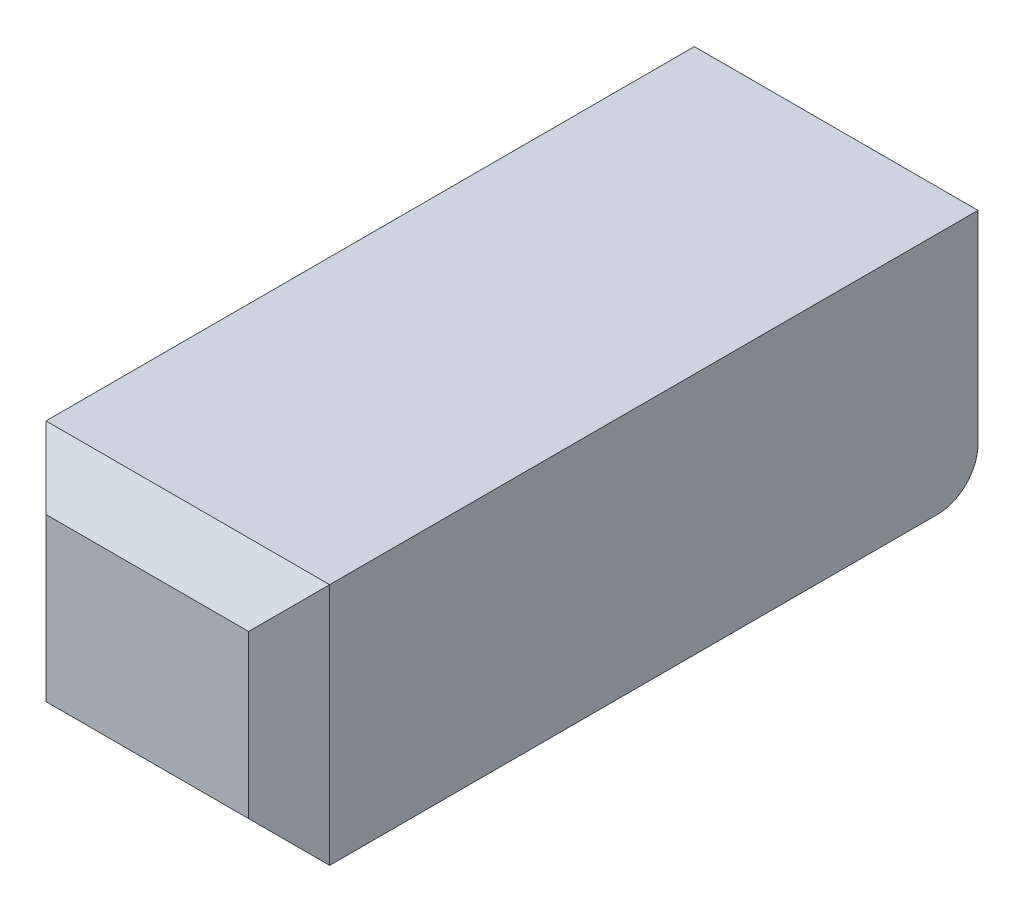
from build123d import *

# Parameters (mm, degrees)
SKETCH1_W           = 0.7
SKETCH1_H           = 1.7
BOSS_EXTRUDE1_DEPTH = 0.6
CHAMFER1_SIZE       = 0.1
FILLET1_R           = 0.1


with BuildPart() as part:
    # Sketch1 → Boss-Extrude1 (new body)
    with BuildSketch(Plane(origin=(0, 0, 0), x_dir=(1, 0, 0), z_dir=(0, 1, 0))):
        Rectangle(SKETCH1_W, SKETCH1_H)
    extrude(amount=BOSS_EXTRUDE1_DEPTH)

    # Chamfer1
    chamfer1_edges = [part.edges().sort_by_distance(p)[0] for p in [
        (0, 0, 0.85),
        (0, 0.6, 0.85),
        (0.35, 0.3, 0.85),
        (-0.35, 0.3, 0.85),
    ]]
    chamfer(chamfer1_edges, length=CHAMFER1_SIZE)

    # Fillet1
    fillet1_edges = [part.edges().sort_by_distance(p)[0] for p in [
        (0, 0, -0.85),
    ]]
    fillet(fillet1_edges, radius=FILLET1_R)


solid = part.part
